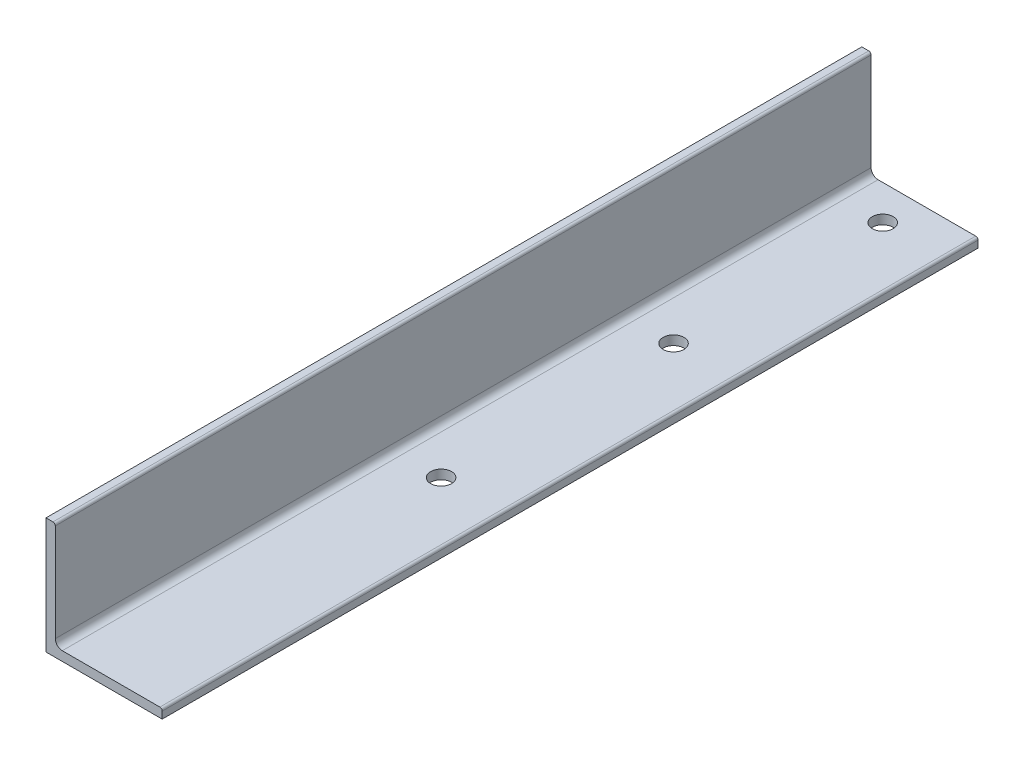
ISO-10303-21;
HEADER;
FILE_DESCRIPTION(('STEP AP214'),'2;1');
FILE_NAME('part.step','',(''),(''),'','','');
FILE_SCHEMA(('AUTOMOTIVE_DESIGN { 1 0 10303 214 1 1 1 1 }'));
ENDSEC;
DATA;
#1=APPLICATION_CONTEXT('core data for automotive mechanical design processes');
#2=APPLICATION_PROTOCOL_DEFINITION('international standard','automotive_design',2000,#1);
#3=PRODUCT_CONTEXT('',#1,'mechanical');
#4=PRODUCT('Part','Part','',(#3));
#5=PRODUCT_RELATED_PRODUCT_CATEGORY('part','',(#4));
#6=PRODUCT_DEFINITION_FORMATION('','',#4);
#7=PRODUCT_DEFINITION_CONTEXT('part definition',#1,'design');
#8=PRODUCT_DEFINITION('design','',#6,#7);
#9=PRODUCT_DEFINITION_SHAPE('','',#8);
#10=(LENGTH_UNIT() NAMED_UNIT(*) SI_UNIT(.MILLI.,.METRE.));
#11=(NAMED_UNIT(*) PLANE_ANGLE_UNIT() SI_UNIT($,.RADIAN.));
#12=(NAMED_UNIT(*) SI_UNIT($,.STERADIAN.) SOLID_ANGLE_UNIT());
#13=UNCERTAINTY_MEASURE_WITH_UNIT(LENGTH_MEASURE(1.E-05),#10,'distance_accuracy_value','');
#14=(GEOMETRIC_REPRESENTATION_CONTEXT(3) GLOBAL_UNCERTAINTY_ASSIGNED_CONTEXT((#13)) GLOBAL_UNIT_ASSIGNED_CONTEXT((#10,
#11,#12)) REPRESENTATION_CONTEXT('',''));
#15=CARTESIAN_POINT('',(0.,0.,0.));
#16=DIRECTION('',(0.,0.,1.));
#17=DIRECTION('',(1.,0.,0.));
#18=AXIS2_PLACEMENT_3D('',#15,#16,#17);
#19=CARTESIAN_POINT('',(5.99999999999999,100.,702.));
#20=DIRECTION('',(0.,-1.,0.));
#21=DIRECTION('',(0.,0.,-1.));
#22=AXIS2_PLACEMENT_3D('',#19,#20,#21);
#23=PLANE('',#22);
#24=DIRECTION('',(-1.,0.,0.));
#25=VECTOR('',#24,1.);
#26=CARTESIAN_POINT('',(5.99999999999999,100.,0.));
#27=LINE('',#26,#25);
#28=CARTESIAN_POINT('',(5.99999999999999,100.,0.));
#29=VERTEX_POINT('',#28);
#30=CARTESIAN_POINT('',(0.,100.,0.));
#31=VERTEX_POINT('',#30);
#32=EDGE_CURVE('E137',#29,#31,#27,.T.);
#33=ORIENTED_EDGE('',*,*,#32,.T.);
#34=DIRECTION('',(0.,0.,-1.));
#35=VECTOR('',#34,1.);
#36=CARTESIAN_POINT('',(0.,100.,702.));
#37=LINE('',#36,#35);
#38=CARTESIAN_POINT('',(0.,100.,702.));
#39=VERTEX_POINT('',#38);
#40=EDGE_CURVE('E11',#39,#31,#37,.T.);
#41=ORIENTED_EDGE('',*,*,#40,.F.);
#42=DIRECTION('',(-1.,0.,0.));
#43=VECTOR('',#42,1.);
#44=CARTESIAN_POINT('',(5.99999999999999,100.,702.));
#45=LINE('',#44,#43);
#46=CARTESIAN_POINT('',(5.99999999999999,100.,702.));
#47=VERTEX_POINT('',#46);
#48=EDGE_CURVE('E154',#47,#39,#45,.T.);
#49=ORIENTED_EDGE('',*,*,#48,.F.);
#50=DIRECTION('',(0.,0.,-1.));
#51=VECTOR('',#50,1.);
#52=CARTESIAN_POINT('',(5.99999999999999,100.,702.));
#53=LINE('',#52,#51);
#54=EDGE_CURVE('E133',#47,#29,#53,.T.);
#55=ORIENTED_EDGE('',*,*,#54,.T.);
#56=EDGE_LOOP('',(#33,#41,#49,#55));
#57=FACE_BOUND('',#56,.T.);
#58=ADVANCED_FACE('F35',(#57),#23,.F.);
#59=CARTESIAN_POINT('',(0.,100.,702.));
#60=DIRECTION('',(1.,0.,0.));
#61=DIRECTION('',(0.,1.,0.));
#62=AXIS2_PLACEMENT_3D('',#59,#60,#61);
#63=PLANE('',#62);
#64=DIRECTION('',(0.,-1.,0.));
#65=VECTOR('',#64,1.);
#66=CARTESIAN_POINT('',(0.,100.,0.));
#67=LINE('',#66,#65);
#68=CARTESIAN_POINT('',(0.,0.,0.));
#69=VERTEX_POINT('',#68);
#70=EDGE_CURVE('E140',#31,#69,#67,.T.);
#71=ORIENTED_EDGE('',*,*,#70,.T.);
#72=DIRECTION('',(0.,0.,-1.));
#73=VECTOR('',#72,1.);
#74=CARTESIAN_POINT('',(0.,0.,702.));
#75=LINE('',#74,#73);
#76=CARTESIAN_POINT('',(0.,0.,702.));
#77=VERTEX_POINT('',#76);
#78=EDGE_CURVE('E43',#77,#69,#75,.T.);
#79=ORIENTED_EDGE('',*,*,#78,.F.);
#80=DIRECTION('',(0.,-1.,0.));
#81=VECTOR('',#80,1.);
#82=CARTESIAN_POINT('',(0.,100.,702.));
#83=LINE('',#82,#81);
#84=EDGE_CURVE('E97',#39,#77,#83,.T.);
#85=ORIENTED_EDGE('',*,*,#84,.F.);
#86=ORIENTED_EDGE('',*,*,#40,.T.);
#87=EDGE_LOOP('',(#71,#79,#85,#86));
#88=FACE_BOUND('',#87,.T.);
#89=ADVANCED_FACE('F244',(#88),#63,.F.);
#90=CARTESIAN_POINT('',(0.,0.,702.));
#91=DIRECTION('',(0.,1.,0.));
#92=DIRECTION('',(0.,0.,1.));
#93=AXIS2_PLACEMENT_3D('',#90,#91,#92);
#94=PLANE('',#93);
#95=CARTESIAN_POINT('',(48.,0.,410.));
#96=DIRECTION('',(0.,1.,0.));
#97=DIRECTION('',(-1.,0.,0.));
#98=AXIS2_PLACEMENT_3D('',#95,#96,#97);
#99=CIRCLE('',#98,9.00000000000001);
#100=CARTESIAN_POINT('',(39.,0.,410.));
#101=VERTEX_POINT('',#100);
#102=EDGE_CURVE('E204',#101,#101,#99,.T.);
#103=ORIENTED_EDGE('',*,*,#102,.T.);
#104=EDGE_LOOP('',(#103));
#105=FACE_BOUND('',#104,.T.);
#106=CARTESIAN_POINT('',(48.,0.,210.));
#107=DIRECTION('',(0.,1.,0.));
#108=DIRECTION('',(-1.,0.,0.));
#109=AXIS2_PLACEMENT_3D('',#106,#107,#108);
#110=CIRCLE('',#109,9.00000000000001);
#111=CARTESIAN_POINT('',(39.,0.,210.));
#112=VERTEX_POINT('',#111);
#113=EDGE_CURVE('E198',#112,#112,#110,.T.);
#114=ORIENTED_EDGE('',*,*,#113,.T.);
#115=EDGE_LOOP('',(#114));
#116=FACE_BOUND('',#115,.T.);
#117=CARTESIAN_POINT('',(48.,0.,30.));
#118=DIRECTION('',(0.,1.,0.));
#119=DIRECTION('',(-1.,0.,0.));
#120=AXIS2_PLACEMENT_3D('',#117,#118,#119);
#121=CIRCLE('',#120,9.00000000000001);
#122=CARTESIAN_POINT('',(39.,0.,30.));
#123=VERTEX_POINT('',#122);
#124=EDGE_CURVE('E141',#123,#123,#121,.T.);
#125=ORIENTED_EDGE('',*,*,#124,.T.);
#126=EDGE_LOOP('',(#125));
#127=FACE_BOUND('',#126,.T.);
#128=DIRECTION('',(1.,0.,0.));
#129=VECTOR('',#128,1.);
#130=CARTESIAN_POINT('',(0.,0.,0.));
#131=LINE('',#130,#129);
#132=CARTESIAN_POINT('',(100.,0.,0.));
#133=VERTEX_POINT('',#132);
#134=EDGE_CURVE('E143',#69,#133,#131,.T.);
#135=ORIENTED_EDGE('',*,*,#134,.T.);
#136=DIRECTION('',(0.,0.,-1.));
#137=VECTOR('',#136,1.);
#138=CARTESIAN_POINT('',(100.,0.,702.));
#139=LINE('',#138,#137);
#140=CARTESIAN_POINT('',(100.,0.,702.));
#141=VERTEX_POINT('',#140);
#142=EDGE_CURVE('E164',#141,#133,#139,.T.);
#143=ORIENTED_EDGE('',*,*,#142,.F.);
#144=DIRECTION('',(1.,0.,0.));
#145=VECTOR('',#144,1.);
#146=CARTESIAN_POINT('',(0.,0.,702.));
#147=LINE('',#146,#145);
#148=EDGE_CURVE('E172',#77,#141,#147,.T.);
#149=ORIENTED_EDGE('',*,*,#148,.F.);
#150=ORIENTED_EDGE('',*,*,#78,.T.);
#151=EDGE_LOOP('',(#135,#143,#149,#150));
#152=FACE_BOUND('',#151,.T.);
#153=ADVANCED_FACE('F170',(#105,#116,#127,#152),#94,.F.);
#154=CARTESIAN_POINT('',(100.,0.,702.));
#155=DIRECTION('',(-1.,0.,0.));
#156=DIRECTION('',(0.,0.,1.));
#157=AXIS2_PLACEMENT_3D('',#154,#155,#156);
#158=PLANE('',#157);
#159=DIRECTION('',(0.,1.,0.));
#160=VECTOR('',#159,1.);
#161=CARTESIAN_POINT('',(100.,0.,0.));
#162=LINE('',#161,#160);
#163=CARTESIAN_POINT('',(100.,6.,0.));
#164=VERTEX_POINT('',#163);
#165=EDGE_CURVE('E145',#133,#164,#162,.T.);
#166=ORIENTED_EDGE('',*,*,#165,.T.);
#167=DIRECTION('',(0.,0.,-1.));
#168=VECTOR('',#167,1.);
#169=CARTESIAN_POINT('',(100.,6.,702.));
#170=LINE('',#169,#168);
#171=CARTESIAN_POINT('',(100.,6.,702.));
#172=VERTEX_POINT('',#171);
#173=EDGE_CURVE('E161',#172,#164,#170,.T.);
#174=ORIENTED_EDGE('',*,*,#173,.F.);
#175=DIRECTION('',(0.,1.,0.));
#176=VECTOR('',#175,1.);
#177=CARTESIAN_POINT('',(100.,0.,702.));
#178=LINE('',#177,#176);
#179=EDGE_CURVE('E188',#141,#172,#178,.T.);
#180=ORIENTED_EDGE('',*,*,#179,.F.);
#181=ORIENTED_EDGE('',*,*,#142,.T.);
#182=EDGE_LOOP('',(#166,#174,#180,#181));
#183=FACE_BOUND('',#182,.T.);
#184=ADVANCED_FACE('F181',(#183),#158,.F.);
#185=CARTESIAN_POINT('',(98.,6.,702.));
#186=DIRECTION('',(0.,0.,-1.));
#187=DIRECTION('',(-1.,0.,0.));
#188=AXIS2_PLACEMENT_3D('',#185,#186,#187);
#189=CYLINDRICAL_SURFACE('',#188,2.);
#190=CARTESIAN_POINT('',(98.,6.,0.));
#191=DIRECTION('',(0.,0.,1.));
#192=DIRECTION('',(1.,0.,0.));
#193=AXIS2_PLACEMENT_3D('',#190,#191,#192);
#194=CIRCLE('',#193,2.);
#195=CARTESIAN_POINT('',(98.,8.,0.));
#196=VERTEX_POINT('',#195);
#197=EDGE_CURVE('E147',#164,#196,#194,.T.);
#198=ORIENTED_EDGE('',*,*,#197,.T.);
#199=DIRECTION('',(0.,0.,-1.));
#200=VECTOR('',#199,1.);
#201=CARTESIAN_POINT('',(98.,8.,702.));
#202=LINE('',#201,#200);
#203=CARTESIAN_POINT('',(98.,8.,702.));
#204=VERTEX_POINT('',#203);
#205=EDGE_CURVE('E158',#204,#196,#202,.T.);
#206=ORIENTED_EDGE('',*,*,#205,.F.);
#207=CARTESIAN_POINT('',(98.,6.,702.));
#208=DIRECTION('',(0.,0.,1.));
#209=DIRECTION('',(1.,0.,0.));
#210=AXIS2_PLACEMENT_3D('',#207,#208,#209);
#211=CIRCLE('',#210,2.);
#212=EDGE_CURVE('E187',#172,#204,#211,.T.);
#213=ORIENTED_EDGE('',*,*,#212,.F.);
#214=ORIENTED_EDGE('',*,*,#173,.T.);
#215=EDGE_LOOP('',(#198,#206,#213,#214));
#216=FACE_BOUND('',#215,.T.);
#217=ADVANCED_FACE('F185',(#216),#189,.T.);
#218=CARTESIAN_POINT('',(98.,8.,702.));
#219=DIRECTION('',(0.,-1.,0.));
#220=DIRECTION('',(1.,0.,0.));
#221=AXIS2_PLACEMENT_3D('',#218,#219,#220);
#222=PLANE('',#221);
#223=CARTESIAN_POINT('',(48.,7.99999999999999,410.));
#224=DIRECTION('',(0.,1.,0.));
#225=DIRECTION('',(-1.,0.,0.));
#226=AXIS2_PLACEMENT_3D('',#223,#224,#225);
#227=CIRCLE('',#226,9.00000000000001);
#228=CARTESIAN_POINT('',(39.,7.99999999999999,410.));
#229=VERTEX_POINT('',#228);
#230=EDGE_CURVE('E207',#229,#229,#227,.T.);
#231=ORIENTED_EDGE('',*,*,#230,.F.);
#232=EDGE_LOOP('',(#231));
#233=FACE_BOUND('',#232,.T.);
#234=CARTESIAN_POINT('',(48.,7.99999999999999,210.));
#235=DIRECTION('',(0.,1.,0.));
#236=DIRECTION('',(-1.,0.,0.));
#237=AXIS2_PLACEMENT_3D('',#234,#235,#236);
#238=CIRCLE('',#237,9.00000000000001);
#239=CARTESIAN_POINT('',(39.,7.99999999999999,210.));
#240=VERTEX_POINT('',#239);
#241=EDGE_CURVE('E201',#240,#240,#238,.T.);
#242=ORIENTED_EDGE('',*,*,#241,.F.);
#243=EDGE_LOOP('',(#242));
#244=FACE_BOUND('',#243,.T.);
#245=CARTESIAN_POINT('',(48.,7.99999999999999,30.));
#246=DIRECTION('',(0.,1.,0.));
#247=DIRECTION('',(-1.,0.,0.));
#248=AXIS2_PLACEMENT_3D('',#245,#246,#247);
#249=CIRCLE('',#248,9.00000000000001);
#250=CARTESIAN_POINT('',(39.,7.99999999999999,30.));
#251=VERTEX_POINT('',#250);
#252=EDGE_CURVE('E195',#251,#251,#249,.T.);
#253=ORIENTED_EDGE('',*,*,#252,.F.);
#254=EDGE_LOOP('',(#253));
#255=FACE_BOUND('',#254,.T.);
#256=DIRECTION('',(-1.,0.,0.));
#257=VECTOR('',#256,1.);
#258=CARTESIAN_POINT('',(98.,8.,0.));
#259=LINE('',#258,#257);
#260=CARTESIAN_POINT('',(14.,7.99999999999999,0.));
#261=VERTEX_POINT('',#260);
#262=EDGE_CURVE('E149',#196,#261,#259,.T.);
#263=ORIENTED_EDGE('',*,*,#262,.T.);
#264=DIRECTION('',(0.,0.,-1.));
#265=VECTOR('',#264,1.);
#266=CARTESIAN_POINT('',(14.,7.99999999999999,702.));
#267=LINE('',#266,#265);
#268=CARTESIAN_POINT('',(14.,7.99999999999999,702.));
#269=VERTEX_POINT('',#268);
#270=EDGE_CURVE('E128',#269,#261,#267,.T.);
#271=ORIENTED_EDGE('',*,*,#270,.F.);
#272=DIRECTION('',(-1.,0.,0.));
#273=VECTOR('',#272,1.);
#274=CARTESIAN_POINT('',(98.,8.,702.));
#275=LINE('',#274,#273);
#276=EDGE_CURVE('E119',#204,#269,#275,.T.);
#277=ORIENTED_EDGE('',*,*,#276,.F.);
#278=ORIENTED_EDGE('',*,*,#205,.T.);
#279=EDGE_LOOP('',(#263,#271,#277,#278));
#280=FACE_BOUND('',#279,.T.);
#281=ADVANCED_FACE('F222',(#233,#244,#255,#280),#222,.F.);
#282=CARTESIAN_POINT('',(14.,14.,702.));
#283=DIRECTION('',(0.,0.,-1.));
#284=DIRECTION('',(-1.,0.,0.));
#285=AXIS2_PLACEMENT_3D('',#282,#283,#284);
#286=CYLINDRICAL_SURFACE('',#285,6.00000000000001);
#287=CARTESIAN_POINT('',(14.,14.,0.));
#288=DIRECTION('',(0.,0.,-1.));
#289=DIRECTION('',(-1.,0.,0.));
#290=AXIS2_PLACEMENT_3D('',#287,#288,#289);
#291=CIRCLE('',#290,6.00000000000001);
#292=CARTESIAN_POINT('',(8.,14.,0.));
#293=VERTEX_POINT('',#292);
#294=EDGE_CURVE('E127',#261,#293,#291,.T.);
#295=ORIENTED_EDGE('',*,*,#294,.T.);
#296=DIRECTION('',(0.,0.,-1.));
#297=VECTOR('',#296,1.);
#298=CARTESIAN_POINT('',(8.,14.,702.));
#299=LINE('',#298,#297);
#300=CARTESIAN_POINT('',(8.,14.,702.));
#301=VERTEX_POINT('',#300);
#302=EDGE_CURVE('E124',#301,#293,#299,.T.);
#303=ORIENTED_EDGE('',*,*,#302,.F.);
#304=CARTESIAN_POINT('',(14.,14.,702.));
#305=DIRECTION('',(0.,0.,-1.));
#306=DIRECTION('',(-1.,0.,0.));
#307=AXIS2_PLACEMENT_3D('',#304,#305,#306);
#308=CIRCLE('',#307,6.00000000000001);
#309=EDGE_CURVE('E113',#269,#301,#308,.T.);
#310=ORIENTED_EDGE('',*,*,#309,.F.);
#311=ORIENTED_EDGE('',*,*,#270,.T.);
#312=EDGE_LOOP('',(#295,#303,#310,#311));
#313=FACE_BOUND('',#312,.T.);
#314=ADVANCED_FACE('F125',(#313),#286,.F.);
#315=CARTESIAN_POINT('',(7.99999999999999,14.,702.));
#316=DIRECTION('',(-1.,0.,0.));
#317=DIRECTION('',(0.,0.,1.));
#318=AXIS2_PLACEMENT_3D('',#315,#316,#317);
#319=PLANE('',#318);
#320=DIRECTION('',(0.,1.,0.));
#321=VECTOR('',#320,1.);
#322=CARTESIAN_POINT('',(7.99999999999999,14.,0.));
#323=LINE('',#322,#321);
#324=CARTESIAN_POINT('',(7.99999999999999,98.,0.));
#325=VERTEX_POINT('',#324);
#326=EDGE_CURVE('E83',#293,#325,#323,.T.);
#327=ORIENTED_EDGE('',*,*,#326,.T.);
#328=DIRECTION('',(0.,0.,-1.));
#329=VECTOR('',#328,1.);
#330=CARTESIAN_POINT('',(7.99999999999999,98.,702.));
#331=LINE('',#330,#329);
#332=CARTESIAN_POINT('',(7.99999999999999,98.,702.));
#333=VERTEX_POINT('',#332);
#334=EDGE_CURVE('E129',#333,#325,#331,.T.);
#335=ORIENTED_EDGE('',*,*,#334,.F.);
#336=DIRECTION('',(0.,1.,0.));
#337=VECTOR('',#336,1.);
#338=CARTESIAN_POINT('',(7.99999999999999,14.,702.));
#339=LINE('',#338,#337);
#340=EDGE_CURVE('E117',#301,#333,#339,.T.);
#341=ORIENTED_EDGE('',*,*,#340,.F.);
#342=ORIENTED_EDGE('',*,*,#302,.T.);
#343=EDGE_LOOP('',(#327,#335,#341,#342));
#344=FACE_BOUND('',#343,.T.);
#345=ADVANCED_FACE('F131',(#344),#319,.F.);
#346=CARTESIAN_POINT('',(5.99999999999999,98.,702.));
#347=DIRECTION('',(0.,0.,-1.));
#348=DIRECTION('',(-1.,0.,0.));
#349=AXIS2_PLACEMENT_3D('',#346,#347,#348);
#350=CYLINDRICAL_SURFACE('',#349,2.);
#351=CARTESIAN_POINT('',(5.99999999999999,98.,0.));
#352=DIRECTION('',(0.,0.,1.));
#353=DIRECTION('',(1.,0.,0.));
#354=AXIS2_PLACEMENT_3D('',#351,#352,#353);
#355=CIRCLE('',#354,2.);
#356=EDGE_CURVE('E89',#325,#29,#355,.T.);
#357=ORIENTED_EDGE('',*,*,#356,.T.);
#358=ORIENTED_EDGE('',*,*,#54,.F.);
#359=CARTESIAN_POINT('',(5.99999999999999,98.,702.));
#360=DIRECTION('',(0.,0.,1.));
#361=DIRECTION('',(1.,0.,0.));
#362=AXIS2_PLACEMENT_3D('',#359,#360,#361);
#363=CIRCLE('',#362,2.);
#364=EDGE_CURVE('E51',#333,#47,#363,.T.);
#365=ORIENTED_EDGE('',*,*,#364,.F.);
#366=ORIENTED_EDGE('',*,*,#334,.T.);
#367=EDGE_LOOP('',(#357,#358,#365,#366));
#368=FACE_BOUND('',#367,.T.);
#369=ADVANCED_FACE('F233',(#368),#350,.T.);
#370=CARTESIAN_POINT('',(98.,6.,702.));
#371=DIRECTION('',(0.,0.,1.));
#372=DIRECTION('',(1.,0.,0.));
#373=AXIS2_PLACEMENT_3D('',#370,#371,#372);
#374=PLANE('',#373);
#375=ORIENTED_EDGE('',*,*,#48,.T.);
#376=ORIENTED_EDGE('',*,*,#84,.T.);
#377=ORIENTED_EDGE('',*,*,#148,.T.);
#378=ORIENTED_EDGE('',*,*,#179,.T.);
#379=ORIENTED_EDGE('',*,*,#212,.T.);
#380=ORIENTED_EDGE('',*,*,#276,.T.);
#381=ORIENTED_EDGE('',*,*,#309,.T.);
#382=ORIENTED_EDGE('',*,*,#340,.T.);
#383=ORIENTED_EDGE('',*,*,#364,.T.);
#384=EDGE_LOOP('',(#375,#376,#377,#378,#379,#380,#381,#382,#383));
#385=FACE_BOUND('',#384,.T.);
#386=ADVANCED_FACE('F115',(#385),#374,.T.);
#387=CARTESIAN_POINT('',(98.,6.,0.));
#388=DIRECTION('',(0.,0.,1.));
#389=DIRECTION('',(1.,0.,0.));
#390=AXIS2_PLACEMENT_3D('',#387,#388,#389);
#391=PLANE('',#390);
#392=ORIENTED_EDGE('',*,*,#32,.F.);
#393=ORIENTED_EDGE('',*,*,#356,.F.);
#394=ORIENTED_EDGE('',*,*,#326,.F.);
#395=ORIENTED_EDGE('',*,*,#294,.F.);
#396=ORIENTED_EDGE('',*,*,#262,.F.);
#397=ORIENTED_EDGE('',*,*,#197,.F.);
#398=ORIENTED_EDGE('',*,*,#165,.F.);
#399=ORIENTED_EDGE('',*,*,#134,.F.);
#400=ORIENTED_EDGE('',*,*,#70,.F.);
#401=EDGE_LOOP('',(#392,#393,#394,#395,#396,#397,#398,#399,#400));
#402=FACE_BOUND('',#401,.T.);
#403=ADVANCED_FACE('F176',(#402),#391,.F.);
#404=CARTESIAN_POINT('',(48.,0.,30.));
#405=DIRECTION('',(0.,1.,0.));
#406=DIRECTION('',(-1.,0.,0.));
#407=AXIS2_PLACEMENT_3D('',#404,#405,#406);
#408=CYLINDRICAL_SURFACE('',#407,9.00000000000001);
#409=ORIENTED_EDGE('',*,*,#124,.F.);
#410=EDGE_LOOP('',(#409));
#411=FACE_BOUND('',#410,.T.);
#412=ORIENTED_EDGE('',*,*,#252,.T.);
#413=EDGE_LOOP('',(#412));
#414=FACE_BOUND('',#413,.T.);
#415=ADVANCED_FACE('F288',(#411,#414),#408,.F.);
#416=CARTESIAN_POINT('',(48.,0.,210.));
#417=DIRECTION('',(0.,1.,0.));
#418=DIRECTION('',(-1.,0.,0.));
#419=AXIS2_PLACEMENT_3D('',#416,#417,#418);
#420=CYLINDRICAL_SURFACE('',#419,9.00000000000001);
#421=ORIENTED_EDGE('',*,*,#113,.F.);
#422=EDGE_LOOP('',(#421));
#423=FACE_BOUND('',#422,.T.);
#424=ORIENTED_EDGE('',*,*,#241,.T.);
#425=EDGE_LOOP('',(#424));
#426=FACE_BOUND('',#425,.T.);
#427=ADVANCED_FACE('F218',(#423,#426),#420,.F.);
#428=CARTESIAN_POINT('',(48.,0.,410.));
#429=DIRECTION('',(0.,1.,0.));
#430=DIRECTION('',(-1.,0.,0.));
#431=AXIS2_PLACEMENT_3D('',#428,#429,#430);
#432=CYLINDRICAL_SURFACE('',#431,9.00000000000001);
#433=ORIENTED_EDGE('',*,*,#102,.F.);
#434=EDGE_LOOP('',(#433));
#435=FACE_BOUND('',#434,.T.);
#436=ORIENTED_EDGE('',*,*,#230,.T.);
#437=EDGE_LOOP('',(#436));
#438=FACE_BOUND('',#437,.T.);
#439=ADVANCED_FACE('F215',(#435,#438),#432,.F.);
#440=CLOSED_SHELL('',(#58,#89,#153,#184,#217,#281,#314,#345,#369,#386,#403,#415,#427,#439));
#441=MANIFOLD_SOLID_BREP('B2',#440);
#442=ADVANCED_BREP_SHAPE_REPRESENTATION('',(#18,#441),#14);
#443=SHAPE_DEFINITION_REPRESENTATION(#9,#442);
ENDSEC;
END-ISO-10303-21;
